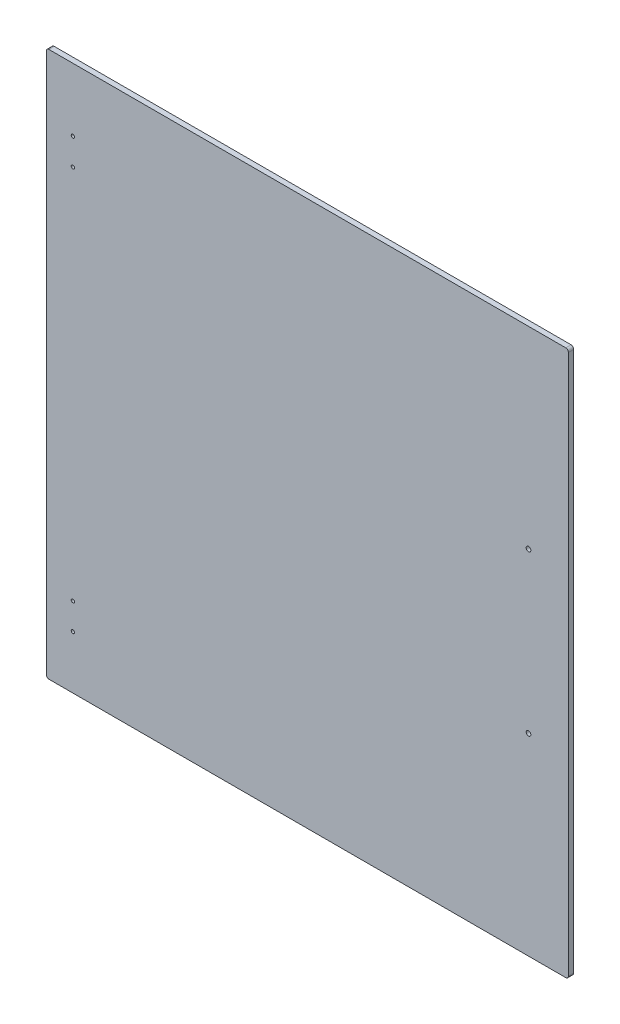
ISO-10303-21;
HEADER;
FILE_DESCRIPTION(('STEP AP214'),'2;1');
FILE_NAME('part.step','',(''),(''),'','','');
FILE_SCHEMA(('AUTOMOTIVE_DESIGN { 1 0 10303 214 1 1 1 1 }'));
ENDSEC;
DATA;
#1=APPLICATION_CONTEXT('core data for automotive mechanical design processes');
#2=APPLICATION_PROTOCOL_DEFINITION('international standard','automotive_design',2000,#1);
#3=PRODUCT_CONTEXT('',#1,'mechanical');
#4=PRODUCT('Part','Part','',(#3));
#5=PRODUCT_RELATED_PRODUCT_CATEGORY('part','',(#4));
#6=PRODUCT_DEFINITION_FORMATION('','',#4);
#7=PRODUCT_DEFINITION_CONTEXT('part definition',#1,'design');
#8=PRODUCT_DEFINITION('design','',#6,#7);
#9=PRODUCT_DEFINITION_SHAPE('','',#8);
#10=(LENGTH_UNIT() NAMED_UNIT(*) SI_UNIT(.MILLI.,.METRE.));
#11=(NAMED_UNIT(*) PLANE_ANGLE_UNIT() SI_UNIT($,.RADIAN.));
#12=(NAMED_UNIT(*) SI_UNIT($,.STERADIAN.) SOLID_ANGLE_UNIT());
#13=UNCERTAINTY_MEASURE_WITH_UNIT(LENGTH_MEASURE(1.E-05),#10,'distance_accuracy_value','');
#14=(GEOMETRIC_REPRESENTATION_CONTEXT(3) GLOBAL_UNCERTAINTY_ASSIGNED_CONTEXT((#13)) GLOBAL_UNIT_ASSIGNED_CONTEXT((#10,
#11,#12)) REPRESENTATION_CONTEXT('',''));
#15=CARTESIAN_POINT('',(0.,0.,0.));
#16=DIRECTION('',(0.,0.,1.));
#17=DIRECTION('',(1.,0.,0.));
#18=AXIS2_PLACEMENT_3D('',#15,#16,#17);
#19=CARTESIAN_POINT('',(196.25,-205.,4.));
#20=DIRECTION('',(-1.,0.,0.));
#21=DIRECTION('',(0.,0.,1.));
#22=AXIS2_PLACEMENT_3D('',#19,#20,#21);
#23=PLANE('',#22);
#24=DIRECTION('',(0.,1.,0.));
#25=VECTOR('',#24,1.);
#26=CARTESIAN_POINT('',(196.25,-205.,4.));
#27=LINE('',#26,#25);
#28=CARTESIAN_POINT('',(196.25,-203.,4.));
#29=VERTEX_POINT('',#28);
#30=CARTESIAN_POINT('',(196.25,203.,4.));
#31=VERTEX_POINT('',#30);
#32=EDGE_CURVE('E135',#29,#31,#27,.T.);
#33=ORIENTED_EDGE('',*,*,#32,.F.);
#34=DIRECTION('',(0.,0.,-1.));
#35=VECTOR('',#34,1.);
#36=CARTESIAN_POINT('',(196.25,-203.,4.));
#37=LINE('',#36,#35);
#38=CARTESIAN_POINT('',(196.25,-203.,0.));
#39=VERTEX_POINT('',#38);
#40=EDGE_CURVE('E175',#29,#39,#37,.T.);
#41=ORIENTED_EDGE('',*,*,#40,.T.);
#42=DIRECTION('',(0.,1.,0.));
#43=VECTOR('',#42,1.);
#44=CARTESIAN_POINT('',(196.25,-205.,0.));
#45=LINE('',#44,#43);
#46=CARTESIAN_POINT('',(196.25,203.,0.));
#47=VERTEX_POINT('',#46);
#48=EDGE_CURVE('E187',#39,#47,#45,.T.);
#49=ORIENTED_EDGE('',*,*,#48,.T.);
#50=DIRECTION('',(0.,0.,-1.));
#51=VECTOR('',#50,1.);
#52=CARTESIAN_POINT('',(196.25,203.,4.));
#53=LINE('',#52,#51);
#54=EDGE_CURVE('E172',#47,#31,#53,.F.);
#55=ORIENTED_EDGE('',*,*,#54,.T.);
#56=EDGE_LOOP('',(#33,#41,#49,#55));
#57=FACE_BOUND('',#56,.T.);
#58=ADVANCED_FACE('F40',(#57),#23,.F.);
#59=CARTESIAN_POINT('',(-196.25,205.,4.));
#60=DIRECTION('',(0.,-1.,0.));
#61=DIRECTION('',(0.,0.,-1.));
#62=AXIS2_PLACEMENT_3D('',#59,#60,#61);
#63=PLANE('',#62);
#64=DIRECTION('',(-1.,0.,0.));
#65=VECTOR('',#64,1.);
#66=CARTESIAN_POINT('',(-196.25,205.,0.));
#67=LINE('',#66,#65);
#68=CARTESIAN_POINT('',(194.25,205.,0.));
#69=VERTEX_POINT('',#68);
#70=CARTESIAN_POINT('',(-194.25,205.,0.));
#71=VERTEX_POINT('',#70);
#72=EDGE_CURVE('E143',#69,#71,#67,.T.);
#73=ORIENTED_EDGE('',*,*,#72,.T.);
#74=DIRECTION('',(0.,0.,-1.));
#75=VECTOR('',#74,1.);
#76=CARTESIAN_POINT('',(-194.25,205.,4.));
#77=LINE('',#76,#75);
#78=CARTESIAN_POINT('',(-194.25,205.,4.));
#79=VERTEX_POINT('',#78);
#80=EDGE_CURVE('E11',#71,#79,#77,.F.);
#81=ORIENTED_EDGE('',*,*,#80,.T.);
#82=DIRECTION('',(-1.,0.,0.));
#83=VECTOR('',#82,1.);
#84=CARTESIAN_POINT('',(-196.25,205.,4.));
#85=LINE('',#84,#83);
#86=CARTESIAN_POINT('',(194.25,205.,4.));
#87=VERTEX_POINT('',#86);
#88=EDGE_CURVE('E141',#87,#79,#85,.T.);
#89=ORIENTED_EDGE('',*,*,#88,.F.);
#90=DIRECTION('',(0.,0.,-1.));
#91=VECTOR('',#90,1.);
#92=CARTESIAN_POINT('',(194.25,205.,4.));
#93=LINE('',#92,#91);
#94=EDGE_CURVE('E49',#87,#69,#93,.T.);
#95=ORIENTED_EDGE('',*,*,#94,.T.);
#96=EDGE_LOOP('',(#73,#81,#89,#95));
#97=FACE_BOUND('',#96,.T.);
#98=ADVANCED_FACE('F183',(#97),#63,.F.);
#99=CARTESIAN_POINT('',(-196.25,-205.,4.));
#100=DIRECTION('',(1.,0.,0.));
#101=DIRECTION('',(0.,0.,-1.));
#102=AXIS2_PLACEMENT_3D('',#99,#100,#101);
#103=PLANE('',#102);
#104=DIRECTION('',(0.,-1.,0.));
#105=VECTOR('',#104,1.);
#106=CARTESIAN_POINT('',(-196.25,-205.,0.));
#107=LINE('',#106,#105);
#108=CARTESIAN_POINT('',(-196.25,203.,0.));
#109=VERTEX_POINT('',#108);
#110=CARTESIAN_POINT('',(-196.25,-203.,0.));
#111=VERTEX_POINT('',#110);
#112=EDGE_CURVE('E136',#109,#111,#107,.T.);
#113=ORIENTED_EDGE('',*,*,#112,.T.);
#114=DIRECTION('',(0.,0.,-1.));
#115=VECTOR('',#114,1.);
#116=CARTESIAN_POINT('',(-196.25,-203.,4.));
#117=LINE('',#116,#115);
#118=CARTESIAN_POINT('',(-196.25,-203.,4.));
#119=VERTEX_POINT('',#118);
#120=EDGE_CURVE('E111',#111,#119,#117,.F.);
#121=ORIENTED_EDGE('',*,*,#120,.T.);
#122=DIRECTION('',(0.,-1.,0.));
#123=VECTOR('',#122,1.);
#124=CARTESIAN_POINT('',(-196.25,-205.,4.));
#125=LINE('',#124,#123);
#126=CARTESIAN_POINT('',(-196.25,203.,4.));
#127=VERTEX_POINT('',#126);
#128=EDGE_CURVE('E195',#127,#119,#125,.T.);
#129=ORIENTED_EDGE('',*,*,#128,.F.);
#130=DIRECTION('',(0.,0.,-1.));
#131=VECTOR('',#130,1.);
#132=CARTESIAN_POINT('',(-196.25,203.,4.));
#133=LINE('',#132,#131);
#134=EDGE_CURVE('E117',#127,#109,#133,.T.);
#135=ORIENTED_EDGE('',*,*,#134,.T.);
#136=EDGE_LOOP('',(#113,#121,#129,#135));
#137=FACE_BOUND('',#136,.T.);
#138=ADVANCED_FACE('F269',(#137),#103,.F.);
#139=CARTESIAN_POINT('',(-196.25,-205.,4.));
#140=DIRECTION('',(0.,1.,0.));
#141=DIRECTION('',(0.,0.,1.));
#142=AXIS2_PLACEMENT_3D('',#139,#140,#141);
#143=PLANE('',#142);
#144=DIRECTION('',(1.,0.,0.));
#145=VECTOR('',#144,1.);
#146=CARTESIAN_POINT('',(-196.25,-205.,4.));
#147=LINE('',#146,#145);
#148=CARTESIAN_POINT('',(-194.25,-205.,4.));
#149=VERTEX_POINT('',#148);
#150=CARTESIAN_POINT('',(194.25,-205.,4.));
#151=VERTEX_POINT('',#150);
#152=EDGE_CURVE('E127',#149,#151,#147,.T.);
#153=ORIENTED_EDGE('',*,*,#152,.F.);
#154=DIRECTION('',(0.,0.,-1.));
#155=VECTOR('',#154,1.);
#156=CARTESIAN_POINT('',(-194.25,-205.,4.));
#157=LINE('',#156,#155);
#158=CARTESIAN_POINT('',(-194.25,-205.,0.));
#159=VERTEX_POINT('',#158);
#160=EDGE_CURVE('E110',#149,#159,#157,.T.);
#161=ORIENTED_EDGE('',*,*,#160,.T.);
#162=DIRECTION('',(1.,0.,0.));
#163=VECTOR('',#162,1.);
#164=CARTESIAN_POINT('',(-196.25,-205.,0.));
#165=LINE('',#164,#163);
#166=CARTESIAN_POINT('',(194.25,-205.,0.));
#167=VERTEX_POINT('',#166);
#168=EDGE_CURVE('E124',#159,#167,#165,.T.);
#169=ORIENTED_EDGE('',*,*,#168,.T.);
#170=DIRECTION('',(0.,0.,-1.));
#171=VECTOR('',#170,1.);
#172=CARTESIAN_POINT('',(194.25,-205.,4.));
#173=LINE('',#172,#171);
#174=EDGE_CURVE('E130',#167,#151,#173,.F.);
#175=ORIENTED_EDGE('',*,*,#174,.T.);
#176=EDGE_LOOP('',(#153,#161,#169,#175));
#177=FACE_BOUND('',#176,.T.);
#178=ADVANCED_FACE('F123',(#177),#143,.F.);
#179=CARTESIAN_POINT('',(0.,0.,4.));
#180=DIRECTION('',(0.,0.,-1.));
#181=DIRECTION('',(-1.,0.,0.));
#182=AXIS2_PLACEMENT_3D('',#179,#180,#181);
#183=PLANE('',#182);
#184=CARTESIAN_POINT('',(166.25,60.,4.));
#185=DIRECTION('',(0.,0.,1.));
#186=DIRECTION('',(1.,0.,0.));
#187=AXIS2_PLACEMENT_3D('',#184,#185,#186);
#188=CIRCLE('',#187,1.75);
#189=CARTESIAN_POINT('',(168.,60.,4.));
#190=VERTEX_POINT('',#189);
#191=EDGE_CURVE('E244',#190,#190,#188,.T.);
#192=ORIENTED_EDGE('',*,*,#191,.F.);
#193=EDGE_LOOP('',(#192));
#194=FACE_BOUND('',#193,.T.);
#195=CARTESIAN_POINT('',(166.25,-60.,4.));
#196=DIRECTION('',(0.,0.,1.));
#197=DIRECTION('',(1.,0.,0.));
#198=AXIS2_PLACEMENT_3D('',#195,#196,#197);
#199=CIRCLE('',#198,1.75);
#200=CARTESIAN_POINT('',(168.,-60.,4.));
#201=VERTEX_POINT('',#200);
#202=EDGE_CURVE('E236',#201,#201,#199,.T.);
#203=ORIENTED_EDGE('',*,*,#202,.F.);
#204=EDGE_LOOP('',(#203));
#205=FACE_BOUND('',#204,.T.);
#206=CARTESIAN_POINT('',(-176.25,157.5,4.));
#207=DIRECTION('',(0.,0.,1.));
#208=DIRECTION('',(1.,0.,0.));
#209=AXIS2_PLACEMENT_3D('',#206,#207,#208);
#210=CIRCLE('',#209,1.25);
#211=CARTESIAN_POINT('',(-175.,157.5,4.));
#212=VERTEX_POINT('',#211);
#213=EDGE_CURVE('E228',#212,#212,#210,.T.);
#214=ORIENTED_EDGE('',*,*,#213,.F.);
#215=EDGE_LOOP('',(#214));
#216=FACE_BOUND('',#215,.T.);
#217=CARTESIAN_POINT('',(-176.25,137.5,4.));
#218=DIRECTION('',(0.,0.,1.));
#219=DIRECTION('',(1.,0.,0.));
#220=AXIS2_PLACEMENT_3D('',#217,#218,#219);
#221=CIRCLE('',#220,1.25);
#222=CARTESIAN_POINT('',(-175.,137.5,4.));
#223=VERTEX_POINT('',#222);
#224=EDGE_CURVE('E220',#223,#223,#221,.T.);
#225=ORIENTED_EDGE('',*,*,#224,.F.);
#226=EDGE_LOOP('',(#225));
#227=FACE_BOUND('',#226,.T.);
#228=CARTESIAN_POINT('',(-176.25,-145.,4.));
#229=DIRECTION('',(0.,0.,1.));
#230=DIRECTION('',(1.,0.,0.));
#231=AXIS2_PLACEMENT_3D('',#228,#229,#230);
#232=CIRCLE('',#231,1.25);
#233=CARTESIAN_POINT('',(-175.,-145.,4.));
#234=VERTEX_POINT('',#233);
#235=EDGE_CURVE('E212',#234,#234,#232,.T.);
#236=ORIENTED_EDGE('',*,*,#235,.F.);
#237=EDGE_LOOP('',(#236));
#238=FACE_BOUND('',#237,.T.);
#239=CARTESIAN_POINT('',(-176.25,-165.,4.));
#240=DIRECTION('',(0.,0.,1.));
#241=DIRECTION('',(1.,0.,0.));
#242=AXIS2_PLACEMENT_3D('',#239,#240,#241);
#243=CIRCLE('',#242,1.25);
#244=CARTESIAN_POINT('',(-175.,-165.,4.));
#245=VERTEX_POINT('',#244);
#246=EDGE_CURVE('E204',#245,#245,#243,.T.);
#247=ORIENTED_EDGE('',*,*,#246,.F.);
#248=EDGE_LOOP('',(#247));
#249=FACE_BOUND('',#248,.T.);
#250=ORIENTED_EDGE('',*,*,#128,.T.);
#251=CARTESIAN_POINT('',(-194.25,-203.,4.));
#252=DIRECTION('',(0.,0.,-1.));
#253=DIRECTION('',(-1.,0.,0.));
#254=AXIS2_PLACEMENT_3D('',#251,#252,#253);
#255=CIRCLE('',#254,2.);
#256=EDGE_CURVE('E169',#119,#149,#255,.F.);
#257=ORIENTED_EDGE('',*,*,#256,.T.);
#258=ORIENTED_EDGE('',*,*,#152,.T.);
#259=CARTESIAN_POINT('',(194.25,-203.,4.));
#260=DIRECTION('',(0.,0.,-1.));
#261=DIRECTION('',(-1.,0.,0.));
#262=AXIS2_PLACEMENT_3D('',#259,#260,#261);
#263=CIRCLE('',#262,2.);
#264=EDGE_CURVE('E166',#151,#29,#263,.F.);
#265=ORIENTED_EDGE('',*,*,#264,.T.);
#266=ORIENTED_EDGE('',*,*,#32,.T.);
#267=CARTESIAN_POINT('',(194.25,203.,4.));
#268=DIRECTION('',(0.,0.,-1.));
#269=DIRECTION('',(-1.,0.,0.));
#270=AXIS2_PLACEMENT_3D('',#267,#268,#269);
#271=CIRCLE('',#270,2.);
#272=EDGE_CURVE('E61',#31,#87,#271,.F.);
#273=ORIENTED_EDGE('',*,*,#272,.T.);
#274=ORIENTED_EDGE('',*,*,#88,.T.);
#275=CARTESIAN_POINT('',(-194.25,203.,4.));
#276=DIRECTION('',(0.,0.,-1.));
#277=DIRECTION('',(-1.,0.,0.));
#278=AXIS2_PLACEMENT_3D('',#275,#276,#277);
#279=CIRCLE('',#278,2.);
#280=EDGE_CURVE('E163',#79,#127,#279,.F.);
#281=ORIENTED_EDGE('',*,*,#280,.T.);
#282=EDGE_LOOP('',(#250,#257,#258,#265,#266,#273,#274,#281));
#283=FACE_BOUND('',#282,.T.);
#284=ADVANCED_FACE('F252',(#194,#205,#216,#227,#238,#249,#283),#183,.F.);
#285=CARTESIAN_POINT('',(0.,0.,0.));
#286=DIRECTION('',(0.,0.,-1.));
#287=DIRECTION('',(-1.,0.,0.));
#288=AXIS2_PLACEMENT_3D('',#285,#286,#287);
#289=PLANE('',#288);
#290=CARTESIAN_POINT('',(166.25,60.,0.));
#291=DIRECTION('',(0.,0.,1.));
#292=DIRECTION('',(1.,0.,0.));
#293=AXIS2_PLACEMENT_3D('',#290,#291,#292);
#294=CIRCLE('',#293,1.75);
#295=CARTESIAN_POINT('',(168.,60.,0.));
#296=VERTEX_POINT('',#295);
#297=EDGE_CURVE('E240',#296,#296,#294,.T.);
#298=ORIENTED_EDGE('',*,*,#297,.T.);
#299=EDGE_LOOP('',(#298));
#300=FACE_BOUND('',#299,.T.);
#301=CARTESIAN_POINT('',(166.25,-60.,0.));
#302=DIRECTION('',(0.,0.,1.));
#303=DIRECTION('',(1.,0.,0.));
#304=AXIS2_PLACEMENT_3D('',#301,#302,#303);
#305=CIRCLE('',#304,1.75);
#306=CARTESIAN_POINT('',(168.,-60.,0.));
#307=VERTEX_POINT('',#306);
#308=EDGE_CURVE('E232',#307,#307,#305,.T.);
#309=ORIENTED_EDGE('',*,*,#308,.T.);
#310=EDGE_LOOP('',(#309));
#311=FACE_BOUND('',#310,.T.);
#312=CARTESIAN_POINT('',(-176.25,157.5,0.));
#313=DIRECTION('',(0.,0.,1.));
#314=DIRECTION('',(1.,0.,0.));
#315=AXIS2_PLACEMENT_3D('',#312,#313,#314);
#316=CIRCLE('',#315,1.25);
#317=CARTESIAN_POINT('',(-175.,157.5,0.));
#318=VERTEX_POINT('',#317);
#319=EDGE_CURVE('E224',#318,#318,#316,.T.);
#320=ORIENTED_EDGE('',*,*,#319,.T.);
#321=EDGE_LOOP('',(#320));
#322=FACE_BOUND('',#321,.T.);
#323=CARTESIAN_POINT('',(-176.25,137.5,0.));
#324=DIRECTION('',(0.,0.,1.));
#325=DIRECTION('',(1.,0.,0.));
#326=AXIS2_PLACEMENT_3D('',#323,#324,#325);
#327=CIRCLE('',#326,1.25);
#328=CARTESIAN_POINT('',(-175.,137.5,0.));
#329=VERTEX_POINT('',#328);
#330=EDGE_CURVE('E216',#329,#329,#327,.T.);
#331=ORIENTED_EDGE('',*,*,#330,.T.);
#332=EDGE_LOOP('',(#331));
#333=FACE_BOUND('',#332,.T.);
#334=CARTESIAN_POINT('',(-176.25,-145.,0.));
#335=DIRECTION('',(0.,0.,1.));
#336=DIRECTION('',(1.,0.,0.));
#337=AXIS2_PLACEMENT_3D('',#334,#335,#336);
#338=CIRCLE('',#337,1.25);
#339=CARTESIAN_POINT('',(-175.,-145.,0.));
#340=VERTEX_POINT('',#339);
#341=EDGE_CURVE('E208',#340,#340,#338,.T.);
#342=ORIENTED_EDGE('',*,*,#341,.T.);
#343=EDGE_LOOP('',(#342));
#344=FACE_BOUND('',#343,.T.);
#345=CARTESIAN_POINT('',(-176.25,-165.,0.));
#346=DIRECTION('',(0.,0.,1.));
#347=DIRECTION('',(1.,0.,0.));
#348=AXIS2_PLACEMENT_3D('',#345,#346,#347);
#349=CIRCLE('',#348,1.25);
#350=CARTESIAN_POINT('',(-175.,-165.,0.));
#351=VERTEX_POINT('',#350);
#352=EDGE_CURVE('E190',#351,#351,#349,.T.);
#353=ORIENTED_EDGE('',*,*,#352,.T.);
#354=EDGE_LOOP('',(#353));
#355=FACE_BOUND('',#354,.T.);
#356=ORIENTED_EDGE('',*,*,#168,.F.);
#357=CARTESIAN_POINT('',(-194.25,-203.,0.));
#358=DIRECTION('',(0.,0.,-1.));
#359=DIRECTION('',(-1.,0.,0.));
#360=AXIS2_PLACEMENT_3D('',#357,#358,#359);
#361=CIRCLE('',#360,2.);
#362=EDGE_CURVE('E106',#159,#111,#361,.T.);
#363=ORIENTED_EDGE('',*,*,#362,.T.);
#364=ORIENTED_EDGE('',*,*,#112,.F.);
#365=CARTESIAN_POINT('',(-194.25,203.,0.));
#366=DIRECTION('',(0.,0.,-1.));
#367=DIRECTION('',(-1.,0.,0.));
#368=AXIS2_PLACEMENT_3D('',#365,#366,#367);
#369=CIRCLE('',#368,2.);
#370=EDGE_CURVE('E151',#109,#71,#369,.T.);
#371=ORIENTED_EDGE('',*,*,#370,.T.);
#372=ORIENTED_EDGE('',*,*,#72,.F.);
#373=CARTESIAN_POINT('',(194.25,203.,0.));
#374=DIRECTION('',(0.,0.,-1.));
#375=DIRECTION('',(-1.,0.,0.));
#376=AXIS2_PLACEMENT_3D('',#373,#374,#375);
#377=CIRCLE('',#376,2.);
#378=EDGE_CURVE('E129',#69,#47,#377,.T.);
#379=ORIENTED_EDGE('',*,*,#378,.T.);
#380=ORIENTED_EDGE('',*,*,#48,.F.);
#381=CARTESIAN_POINT('',(194.25,-203.,0.));
#382=DIRECTION('',(0.,0.,-1.));
#383=DIRECTION('',(-1.,0.,0.));
#384=AXIS2_PLACEMENT_3D('',#381,#382,#383);
#385=CIRCLE('',#384,2.);
#386=EDGE_CURVE('E118',#39,#167,#385,.T.);
#387=ORIENTED_EDGE('',*,*,#386,.T.);
#388=EDGE_LOOP('',(#356,#363,#364,#371,#372,#379,#380,#387));
#389=FACE_BOUND('',#388,.T.);
#390=ADVANCED_FACE('F132',(#300,#311,#322,#333,#344,#355,#389),#289,.T.);
#391=CARTESIAN_POINT('',(-194.25,-203.,4.));
#392=DIRECTION('',(0.,0.,-1.));
#393=DIRECTION('',(-1.,0.,0.));
#394=AXIS2_PLACEMENT_3D('',#391,#392,#393);
#395=CYLINDRICAL_SURFACE('',#394,2.);
#396=ORIENTED_EDGE('',*,*,#256,.F.);
#397=ORIENTED_EDGE('',*,*,#120,.F.);
#398=ORIENTED_EDGE('',*,*,#362,.F.);
#399=ORIENTED_EDGE('',*,*,#160,.F.);
#400=EDGE_LOOP('',(#396,#397,#398,#399));
#401=FACE_BOUND('',#400,.T.);
#402=ADVANCED_FACE('F109',(#401),#395,.T.);
#403=CARTESIAN_POINT('',(194.25,-203.,4.));
#404=DIRECTION('',(0.,0.,-1.));
#405=DIRECTION('',(-1.,0.,0.));
#406=AXIS2_PLACEMENT_3D('',#403,#404,#405);
#407=CYLINDRICAL_SURFACE('',#406,2.);
#408=ORIENTED_EDGE('',*,*,#264,.F.);
#409=ORIENTED_EDGE('',*,*,#174,.F.);
#410=ORIENTED_EDGE('',*,*,#386,.F.);
#411=ORIENTED_EDGE('',*,*,#40,.F.);
#412=EDGE_LOOP('',(#408,#409,#410,#411));
#413=FACE_BOUND('',#412,.T.);
#414=ADVANCED_FACE('F273',(#413),#407,.T.);
#415=CARTESIAN_POINT('',(-194.25,203.,4.));
#416=DIRECTION('',(0.,0.,-1.));
#417=DIRECTION('',(-1.,0.,0.));
#418=AXIS2_PLACEMENT_3D('',#415,#416,#417);
#419=CYLINDRICAL_SURFACE('',#418,2.);
#420=ORIENTED_EDGE('',*,*,#280,.F.);
#421=ORIENTED_EDGE('',*,*,#80,.F.);
#422=ORIENTED_EDGE('',*,*,#370,.F.);
#423=ORIENTED_EDGE('',*,*,#134,.F.);
#424=EDGE_LOOP('',(#420,#421,#422,#423));
#425=FACE_BOUND('',#424,.T.);
#426=ADVANCED_FACE('F271',(#425),#419,.T.);
#427=CARTESIAN_POINT('',(194.25,203.,4.));
#428=DIRECTION('',(0.,0.,-1.));
#429=DIRECTION('',(-1.,0.,0.));
#430=AXIS2_PLACEMENT_3D('',#427,#428,#429);
#431=CYLINDRICAL_SURFACE('',#430,2.);
#432=ORIENTED_EDGE('',*,*,#272,.F.);
#433=ORIENTED_EDGE('',*,*,#54,.F.);
#434=ORIENTED_EDGE('',*,*,#378,.F.);
#435=ORIENTED_EDGE('',*,*,#94,.F.);
#436=EDGE_LOOP('',(#432,#433,#434,#435));
#437=FACE_BOUND('',#436,.T.);
#438=ADVANCED_FACE('F42',(#437),#431,.T.);
#439=CARTESIAN_POINT('',(-176.25,-165.,4.));
#440=DIRECTION('',(0.,0.,1.));
#441=DIRECTION('',(1.,0.,0.));
#442=AXIS2_PLACEMENT_3D('',#439,#440,#441);
#443=CYLINDRICAL_SURFACE('',#442,1.25);
#444=ORIENTED_EDGE('',*,*,#352,.F.);
#445=EDGE_LOOP('',(#444));
#446=FACE_BOUND('',#445,.T.);
#447=ORIENTED_EDGE('',*,*,#246,.T.);
#448=EDGE_LOOP('',(#447));
#449=FACE_BOUND('',#448,.T.);
#450=ADVANCED_FACE('F278',(#446,#449),#443,.F.);
#451=CARTESIAN_POINT('',(-176.25,-145.,4.));
#452=DIRECTION('',(0.,0.,1.));
#453=DIRECTION('',(1.,0.,0.));
#454=AXIS2_PLACEMENT_3D('',#451,#452,#453);
#455=CYLINDRICAL_SURFACE('',#454,1.25);
#456=ORIENTED_EDGE('',*,*,#341,.F.);
#457=EDGE_LOOP('',(#456));
#458=FACE_BOUND('',#457,.T.);
#459=ORIENTED_EDGE('',*,*,#235,.T.);
#460=EDGE_LOOP('',(#459));
#461=FACE_BOUND('',#460,.T.);
#462=ADVANCED_FACE('F352',(#458,#461),#455,.F.);
#463=CARTESIAN_POINT('',(-176.25,137.5,4.));
#464=DIRECTION('',(0.,0.,1.));
#465=DIRECTION('',(1.,0.,0.));
#466=AXIS2_PLACEMENT_3D('',#463,#464,#465);
#467=CYLINDRICAL_SURFACE('',#466,1.25);
#468=ORIENTED_EDGE('',*,*,#330,.F.);
#469=EDGE_LOOP('',(#468));
#470=FACE_BOUND('',#469,.T.);
#471=ORIENTED_EDGE('',*,*,#224,.T.);
#472=EDGE_LOOP('',(#471));
#473=FACE_BOUND('',#472,.T.);
#474=ADVANCED_FACE('F360',(#470,#473),#467,.F.);
#475=CARTESIAN_POINT('',(-176.25,157.5,4.));
#476=DIRECTION('',(0.,0.,1.));
#477=DIRECTION('',(1.,0.,0.));
#478=AXIS2_PLACEMENT_3D('',#475,#476,#477);
#479=CYLINDRICAL_SURFACE('',#478,1.25);
#480=ORIENTED_EDGE('',*,*,#319,.F.);
#481=EDGE_LOOP('',(#480));
#482=FACE_BOUND('',#481,.T.);
#483=ORIENTED_EDGE('',*,*,#213,.T.);
#484=EDGE_LOOP('',(#483));
#485=FACE_BOUND('',#484,.T.);
#486=ADVANCED_FACE('F370',(#482,#485),#479,.F.);
#487=CARTESIAN_POINT('',(166.25,-60.,4.));
#488=DIRECTION('',(0.,0.,1.));
#489=DIRECTION('',(1.,0.,0.));
#490=AXIS2_PLACEMENT_3D('',#487,#488,#489);
#491=CYLINDRICAL_SURFACE('',#490,1.75);
#492=ORIENTED_EDGE('',*,*,#308,.F.);
#493=EDGE_LOOP('',(#492));
#494=FACE_BOUND('',#493,.T.);
#495=ORIENTED_EDGE('',*,*,#202,.T.);
#496=EDGE_LOOP('',(#495));
#497=FACE_BOUND('',#496,.T.);
#498=ADVANCED_FACE('F380',(#494,#497),#491,.F.);
#499=CARTESIAN_POINT('',(166.25,60.,4.));
#500=DIRECTION('',(0.,0.,1.));
#501=DIRECTION('',(1.,0.,0.));
#502=AXIS2_PLACEMENT_3D('',#499,#500,#501);
#503=CYLINDRICAL_SURFACE('',#502,1.75);
#504=ORIENTED_EDGE('',*,*,#297,.F.);
#505=EDGE_LOOP('',(#504));
#506=FACE_BOUND('',#505,.T.);
#507=ORIENTED_EDGE('',*,*,#191,.T.);
#508=EDGE_LOOP('',(#507));
#509=FACE_BOUND('',#508,.T.);
#510=ADVANCED_FACE('F250',(#506,#509),#503,.F.);
#511=CLOSED_SHELL('',(#58,#98,#138,#178,#284,#390,#402,#414,#426,#438,#450,#462,#474,#486,#498,#510));
#512=MANIFOLD_SOLID_BREP('B2',#511);
#513=ADVANCED_BREP_SHAPE_REPRESENTATION('',(#18,#512),#14);
#514=SHAPE_DEFINITION_REPRESENTATION(#9,#513);
ENDSEC;
END-ISO-10303-21;
